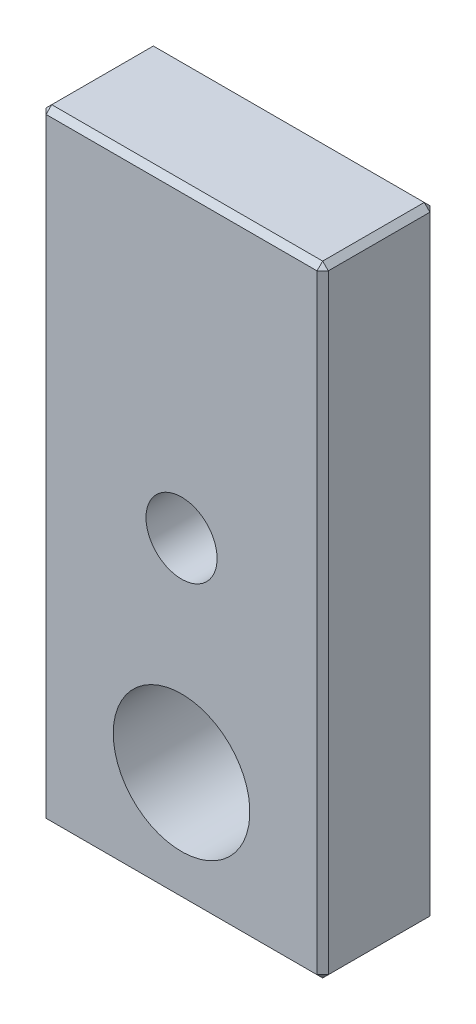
ISO-10303-21;
HEADER;
FILE_DESCRIPTION(('STEP AP214'),'2;1');
FILE_NAME('part.step','',(''),(''),'','','');
FILE_SCHEMA(('AUTOMOTIVE_DESIGN { 1 0 10303 214 1 1 1 1 }'));
ENDSEC;
DATA;
#1=APPLICATION_CONTEXT('core data for automotive mechanical design processes');
#2=APPLICATION_PROTOCOL_DEFINITION('international standard','automotive_design',2000,#1);
#3=PRODUCT_CONTEXT('',#1,'mechanical');
#4=PRODUCT('Part','Part','',(#3));
#5=PRODUCT_RELATED_PRODUCT_CATEGORY('part','',(#4));
#6=PRODUCT_DEFINITION_FORMATION('','',#4);
#7=PRODUCT_DEFINITION_CONTEXT('part definition',#1,'design');
#8=PRODUCT_DEFINITION('design','',#6,#7);
#9=PRODUCT_DEFINITION_SHAPE('','',#8);
#10=(LENGTH_UNIT() NAMED_UNIT(*) SI_UNIT(.MILLI.,.METRE.));
#11=(NAMED_UNIT(*) PLANE_ANGLE_UNIT() SI_UNIT($,.RADIAN.));
#12=(NAMED_UNIT(*) SI_UNIT($,.STERADIAN.) SOLID_ANGLE_UNIT());
#13=UNCERTAINTY_MEASURE_WITH_UNIT(LENGTH_MEASURE(1.E-05),#10,'distance_accuracy_value','');
#14=(GEOMETRIC_REPRESENTATION_CONTEXT(3) GLOBAL_UNCERTAINTY_ASSIGNED_CONTEXT((#13)) GLOBAL_UNIT_ASSIGNED_CONTEXT((#10,
#11,#12)) REPRESENTATION_CONTEXT('',''));
#15=CARTESIAN_POINT('',(0.,0.,0.));
#16=DIRECTION('',(0.,0.,1.));
#17=DIRECTION('',(1.,0.,0.));
#18=AXIS2_PLACEMENT_3D('',#15,#16,#17);
#19=CARTESIAN_POINT('',(-12.25,44.75,9.5));
#20=DIRECTION('',(-0.577350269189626,0.577350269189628,0.577350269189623));
#21=DIRECTION('',(-0.707106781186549,-0.707106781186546,0.));
#22=AXIS2_PLACEMENT_3D('',#19,#20,#21);
#23=PLANE('',#22);
#24=DIRECTION('',(0.,-0.707106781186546,0.707106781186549));
#25=VECTOR('',#24,1.);
#26=CARTESIAN_POINT('',(-12.,44.75,9.75));
#27=LINE('',#26,#25);
#28=CARTESIAN_POINT('',(-12.,45.,9.5));
#29=VERTEX_POINT('',#28);
#30=CARTESIAN_POINT('',(-12.,44.5,10.));
#31=VERTEX_POINT('',#30);
#32=EDGE_CURVE('E329',#29,#31,#27,.T.);
#33=ORIENTED_EDGE('',*,*,#32,.F.);
#34=DIRECTION('',(-0.707106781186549,-0.707106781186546,0.));
#35=VECTOR('',#34,1.);
#36=CARTESIAN_POINT('',(-12.25,44.75,9.5));
#37=LINE('',#36,#35);
#38=CARTESIAN_POINT('',(-12.5,44.5,9.5));
#39=VERTEX_POINT('',#38);
#40=EDGE_CURVE('E303',#39,#29,#37,.F.);
#41=ORIENTED_EDGE('',*,*,#40,.F.);
#42=DIRECTION('',(0.707106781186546,0.,0.707106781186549));
#43=VECTOR('',#42,1.);
#44=CARTESIAN_POINT('',(-12.25,44.5,9.75000000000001));
#45=LINE('',#44,#43);
#46=EDGE_CURVE('E313',#31,#39,#45,.F.);
#47=ORIENTED_EDGE('',*,*,#46,.F.);
#48=EDGE_LOOP('',(#33,#41,#47));
#49=FACE_BOUND('',#48,.T.);
#50=ADVANCED_FACE('F17',(#49),#23,.T.);
#51=CARTESIAN_POINT('',(-12.25,-9.75,9.5));
#52=DIRECTION('',(-0.577350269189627,-0.577350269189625,0.577350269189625));
#53=DIRECTION('',(0.707106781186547,0.,0.707106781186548));
#54=AXIS2_PLACEMENT_3D('',#51,#52,#53);
#55=PLANE('',#54);
#56=DIRECTION('',(0.,-0.707106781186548,-0.707106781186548));
#57=VECTOR('',#56,1.);
#58=CARTESIAN_POINT('',(-12.,-9.75,9.75));
#59=LINE('',#58,#57);
#60=CARTESIAN_POINT('',(-12.,-9.5,10.));
#61=VERTEX_POINT('',#60);
#62=CARTESIAN_POINT('',(-12.,-10.,9.5));
#63=VERTEX_POINT('',#62);
#64=EDGE_CURVE('E127',#61,#63,#59,.T.);
#65=ORIENTED_EDGE('',*,*,#64,.F.);
#66=DIRECTION('',(0.707106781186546,0.,0.707106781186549));
#67=VECTOR('',#66,1.);
#68=CARTESIAN_POINT('',(-12.25,-9.5,9.75));
#69=LINE('',#68,#67);
#70=CARTESIAN_POINT('',(-12.5,-9.5,9.5));
#71=VERTEX_POINT('',#70);
#72=EDGE_CURVE('E310',#71,#61,#69,.T.);
#73=ORIENTED_EDGE('',*,*,#72,.F.);
#74=DIRECTION('',(0.707106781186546,-0.707106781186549,0.));
#75=VECTOR('',#74,1.);
#76=CARTESIAN_POINT('',(-12.25,-9.75,9.5));
#77=LINE('',#76,#75);
#78=EDGE_CURVE('E126',#63,#71,#77,.F.);
#79=ORIENTED_EDGE('',*,*,#78,.F.);
#80=EDGE_LOOP('',(#65,#73,#79));
#81=FACE_BOUND('',#80,.T.);
#82=ADVANCED_FACE('F323',(#81),#55,.T.);
#83=CARTESIAN_POINT('',(12.,45.,9.5));
#84=DIRECTION('',(0.577350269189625,0.577350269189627,0.577350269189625));
#85=DIRECTION('',(0.,-0.707106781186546,0.707106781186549));
#86=AXIS2_PLACEMENT_3D('',#83,#84,#85);
#87=PLANE('',#86);
#88=DIRECTION('',(-0.707106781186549,0.707106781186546,0.));
#89=VECTOR('',#88,1.);
#90=CARTESIAN_POINT('',(12.25,44.75,9.5));
#91=LINE('',#90,#89);
#92=CARTESIAN_POINT('',(12.,45.,9.5));
#93=VERTEX_POINT('',#92);
#94=CARTESIAN_POINT('',(12.5,44.5,9.5));
#95=VERTEX_POINT('',#94);
#96=EDGE_CURVE('E149',#93,#95,#91,.F.);
#97=ORIENTED_EDGE('',*,*,#96,.F.);
#98=DIRECTION('',(0.,-0.707106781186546,0.707106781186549));
#99=VECTOR('',#98,1.);
#100=CARTESIAN_POINT('',(12.,44.75,9.75));
#101=LINE('',#100,#99);
#102=CARTESIAN_POINT('',(12.,44.5,10.));
#103=VERTEX_POINT('',#102);
#104=EDGE_CURVE('E330',#103,#93,#101,.F.);
#105=ORIENTED_EDGE('',*,*,#104,.F.);
#106=DIRECTION('',(0.707106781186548,0.,-0.707106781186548));
#107=VECTOR('',#106,1.);
#108=CARTESIAN_POINT('',(12.25,44.5,9.75));
#109=LINE('',#108,#107);
#110=EDGE_CURVE('E148',#95,#103,#109,.F.);
#111=ORIENTED_EDGE('',*,*,#110,.F.);
#112=EDGE_LOOP('',(#97,#105,#111));
#113=FACE_BOUND('',#112,.T.);
#114=ADVANCED_FACE('F338',(#113),#87,.T.);
#115=CARTESIAN_POINT('',(12.25,-9.75,9.5));
#116=DIRECTION('',(0.577350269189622,-0.577350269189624,0.577350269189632));
#117=DIRECTION('',(0.,-0.707106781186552,-0.707106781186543));
#118=AXIS2_PLACEMENT_3D('',#115,#116,#117);
#119=PLANE('',#118);
#120=DIRECTION('',(0.707106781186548,0.,-0.707106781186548));
#121=VECTOR('',#120,1.);
#122=CARTESIAN_POINT('',(12.25,-9.50000000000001,9.74999999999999));
#123=LINE('',#122,#121);
#124=CARTESIAN_POINT('',(12.,-9.5,10.));
#125=VERTEX_POINT('',#124);
#126=CARTESIAN_POINT('',(12.5,-9.50000000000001,9.5));
#127=VERTEX_POINT('',#126);
#128=EDGE_CURVE('E142',#125,#127,#123,.T.);
#129=ORIENTED_EDGE('',*,*,#128,.F.);
#130=DIRECTION('',(0.,-0.707106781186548,-0.707106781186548));
#131=VECTOR('',#130,1.);
#132=CARTESIAN_POINT('',(12.,-9.75,9.75));
#133=LINE('',#132,#131);
#134=CARTESIAN_POINT('',(12.,-10.,9.5));
#135=VERTEX_POINT('',#134);
#136=EDGE_CURVE('E117',#135,#125,#133,.F.);
#137=ORIENTED_EDGE('',*,*,#136,.F.);
#138=DIRECTION('',(0.707106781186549,0.707106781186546,0.));
#139=VECTOR('',#138,1.);
#140=CARTESIAN_POINT('',(12.25,-9.75,9.5));
#141=LINE('',#140,#139);
#142=EDGE_CURVE('E144',#127,#135,#141,.F.);
#143=ORIENTED_EDGE('',*,*,#142,.F.);
#144=EDGE_LOOP('',(#129,#137,#143));
#145=FACE_BOUND('',#144,.T.);
#146=ADVANCED_FACE('F143',(#145),#119,.T.);
#147=CARTESIAN_POINT('',(-6.25000000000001,44.75,9.75));
#148=DIRECTION('',(0.,0.707106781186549,0.707106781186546));
#149=DIRECTION('',(0.,-0.707106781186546,0.707106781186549));
#150=AXIS2_PLACEMENT_3D('',#147,#148,#149);
#151=PLANE('',#150);
#152=ORIENTED_EDGE('',*,*,#32,.T.);
#153=DIRECTION('',(1.,0.,0.));
#154=VECTOR('',#153,1.);
#155=CARTESIAN_POINT('',(0.,44.5,10.));
#156=LINE('',#155,#154);
#157=EDGE_CURVE('E162',#103,#31,#156,.F.);
#158=ORIENTED_EDGE('',*,*,#157,.F.);
#159=ORIENTED_EDGE('',*,*,#104,.T.);
#160=DIRECTION('',(1.,0.,0.));
#161=VECTOR('',#160,1.);
#162=CARTESIAN_POINT('',(-12.5,45.,9.5));
#163=LINE('',#162,#161);
#164=EDGE_CURVE('E164',#29,#93,#163,.T.);
#165=ORIENTED_EDGE('',*,*,#164,.F.);
#166=EDGE_LOOP('',(#152,#158,#159,#165));
#167=FACE_BOUND('',#166,.T.);
#168=ADVANCED_FACE('F336',(#167),#151,.T.);
#169=CARTESIAN_POINT('',(-12.25,3.75,9.75));
#170=DIRECTION('',(-0.707106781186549,0.,0.707106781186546));
#171=DIRECTION('',(0.707106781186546,0.,0.707106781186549));
#172=AXIS2_PLACEMENT_3D('',#169,#170,#171);
#173=PLANE('',#172);
#174=ORIENTED_EDGE('',*,*,#72,.T.);
#175=DIRECTION('',(0.,1.,0.));
#176=VECTOR('',#175,1.);
#177=CARTESIAN_POINT('',(-12.,17.5,10.));
#178=LINE('',#177,#176);
#179=EDGE_CURVE('E139',#31,#61,#178,.F.);
#180=ORIENTED_EDGE('',*,*,#179,.F.);
#181=ORIENTED_EDGE('',*,*,#46,.T.);
#182=DIRECTION('',(0.,-1.,0.));
#183=VECTOR('',#182,1.);
#184=CARTESIAN_POINT('',(-12.5,-10.,9.5));
#185=LINE('',#184,#183);
#186=EDGE_CURVE('E174',#71,#39,#185,.F.);
#187=ORIENTED_EDGE('',*,*,#186,.F.);
#188=EDGE_LOOP('',(#174,#180,#181,#187));
#189=FACE_BOUND('',#188,.T.);
#190=ADVANCED_FACE('F325',(#189),#173,.T.);
#191=CARTESIAN_POINT('',(-12.25,44.75,0.));
#192=DIRECTION('',(-0.707106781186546,0.707106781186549,0.));
#193=DIRECTION('',(-0.707106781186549,-0.707106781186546,0.));
#194=AXIS2_PLACEMENT_3D('',#191,#192,#193);
#195=PLANE('',#194);
#196=DIRECTION('',(-0.707106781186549,-0.707106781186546,0.));
#197=VECTOR('',#196,1.);
#198=CARTESIAN_POINT('',(-12.25,44.75,0.5));
#199=LINE('',#198,#197);
#200=CARTESIAN_POINT('',(-12.,45.,0.5));
#201=VERTEX_POINT('',#200);
#202=CARTESIAN_POINT('',(-12.5,44.5,0.499999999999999));
#203=VERTEX_POINT('',#202);
#204=EDGE_CURVE('E304',#201,#203,#199,.T.);
#205=ORIENTED_EDGE('',*,*,#204,.T.);
#206=DIRECTION('',(0.,0.,1.));
#207=VECTOR('',#206,1.);
#208=CARTESIAN_POINT('',(-12.5,44.5,0.));
#209=LINE('',#208,#207);
#210=EDGE_CURVE('E170',#39,#203,#209,.F.);
#211=ORIENTED_EDGE('',*,*,#210,.F.);
#212=ORIENTED_EDGE('',*,*,#40,.T.);
#213=DIRECTION('',(0.,0.,1.));
#214=VECTOR('',#213,1.);
#215=CARTESIAN_POINT('',(-12.,45.,0.));
#216=LINE('',#215,#214);
#217=EDGE_CURVE('E156',#201,#29,#216,.T.);
#218=ORIENTED_EDGE('',*,*,#217,.F.);
#219=EDGE_LOOP('',(#205,#211,#212,#218));
#220=FACE_BOUND('',#219,.T.);
#221=ADVANCED_FACE('F301',(#220),#195,.T.);
#222=CARTESIAN_POINT('',(6.25,-9.75,9.75));
#223=DIRECTION('',(0.,-0.707106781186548,0.707106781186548));
#224=DIRECTION('',(0.,-0.707106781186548,-0.707106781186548));
#225=AXIS2_PLACEMENT_3D('',#222,#223,#224);
#226=PLANE('',#225);
#227=ORIENTED_EDGE('',*,*,#136,.T.);
#228=DIRECTION('',(1.,0.,0.));
#229=VECTOR('',#228,1.);
#230=CARTESIAN_POINT('',(0.,-9.5,10.));
#231=LINE('',#230,#229);
#232=EDGE_CURVE('E120',#61,#125,#231,.T.);
#233=ORIENTED_EDGE('',*,*,#232,.F.);
#234=ORIENTED_EDGE('',*,*,#64,.T.);
#235=DIRECTION('',(1.,0.,0.));
#236=VECTOR('',#235,1.);
#237=CARTESIAN_POINT('',(12.5,-10.,9.5));
#238=LINE('',#237,#236);
#239=EDGE_CURVE('E122',#135,#63,#238,.F.);
#240=ORIENTED_EDGE('',*,*,#239,.F.);
#241=EDGE_LOOP('',(#227,#233,#234,#240));
#242=FACE_BOUND('',#241,.T.);
#243=ADVANCED_FACE('F119',(#242),#226,.T.);
#244=CARTESIAN_POINT('',(-12.25,-9.75,0.));
#245=DIRECTION('',(-0.707106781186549,-0.707106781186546,0.));
#246=DIRECTION('',(0.707106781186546,-0.707106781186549,0.));
#247=AXIS2_PLACEMENT_3D('',#244,#245,#246);
#248=PLANE('',#247);
#249=DIRECTION('',(0.707106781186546,-0.707106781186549,0.));
#250=VECTOR('',#249,1.);
#251=CARTESIAN_POINT('',(-12.25,-9.75,0.5));
#252=LINE('',#251,#250);
#253=CARTESIAN_POINT('',(-12.5,-9.5,0.5));
#254=VERTEX_POINT('',#253);
#255=CARTESIAN_POINT('',(-12.,-10.,0.5));
#256=VERTEX_POINT('',#255);
#257=EDGE_CURVE('E286',#254,#256,#252,.T.);
#258=ORIENTED_EDGE('',*,*,#257,.T.);
#259=DIRECTION('',(0.,0.,-1.));
#260=VECTOR('',#259,1.);
#261=CARTESIAN_POINT('',(-12.,-10.,0.));
#262=LINE('',#261,#260);
#263=EDGE_CURVE('E179',#63,#256,#262,.T.);
#264=ORIENTED_EDGE('',*,*,#263,.F.);
#265=ORIENTED_EDGE('',*,*,#78,.T.);
#266=DIRECTION('',(0.,0.,1.));
#267=VECTOR('',#266,1.);
#268=CARTESIAN_POINT('',(-12.5,-9.5,0.));
#269=LINE('',#268,#267);
#270=EDGE_CURVE('E167',#254,#71,#269,.T.);
#271=ORIENTED_EDGE('',*,*,#270,.F.);
#272=EDGE_LOOP('',(#258,#264,#265,#271));
#273=FACE_BOUND('',#272,.T.);
#274=ADVANCED_FACE('F291',(#273),#248,.T.);
#275=CARTESIAN_POINT('',(12.25,44.75,0.));
#276=DIRECTION('',(0.707106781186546,0.707106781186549,0.));
#277=DIRECTION('',(-0.707106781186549,0.707106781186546,0.));
#278=AXIS2_PLACEMENT_3D('',#275,#276,#277);
#279=PLANE('',#278);
#280=DIRECTION('',(0.707106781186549,-0.707106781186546,0.));
#281=VECTOR('',#280,1.);
#282=CARTESIAN_POINT('',(12.,45.,0.500000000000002));
#283=LINE('',#282,#281);
#284=CARTESIAN_POINT('',(12.,45.,0.5));
#285=VERTEX_POINT('',#284);
#286=CARTESIAN_POINT('',(12.5,44.5,0.5));
#287=VERTEX_POINT('',#286);
#288=EDGE_CURVE('E182',#285,#287,#283,.T.);
#289=ORIENTED_EDGE('',*,*,#288,.F.);
#290=DIRECTION('',(0.,0.,1.));
#291=VECTOR('',#290,1.);
#292=CARTESIAN_POINT('',(12.,45.,0.));
#293=LINE('',#292,#291);
#294=EDGE_CURVE('E154',#93,#285,#293,.F.);
#295=ORIENTED_EDGE('',*,*,#294,.F.);
#296=ORIENTED_EDGE('',*,*,#96,.T.);
#297=DIRECTION('',(0.,0.,1.));
#298=VECTOR('',#297,1.);
#299=CARTESIAN_POINT('',(12.5,44.5,0.));
#300=LINE('',#299,#298);
#301=EDGE_CURVE('E187',#287,#95,#300,.T.);
#302=ORIENTED_EDGE('',*,*,#301,.F.);
#303=EDGE_LOOP('',(#289,#295,#296,#302));
#304=FACE_BOUND('',#303,.T.);
#305=ADVANCED_FACE('F345',(#304),#279,.T.);
#306=CARTESIAN_POINT('',(12.25,31.25,9.75));
#307=DIRECTION('',(0.707106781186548,0.,0.707106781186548));
#308=DIRECTION('',(0.707106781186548,0.,-0.707106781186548));
#309=AXIS2_PLACEMENT_3D('',#306,#307,#308);
#310=PLANE('',#309);
#311=ORIENTED_EDGE('',*,*,#110,.T.);
#312=DIRECTION('',(0.,1.,0.));
#313=VECTOR('',#312,1.);
#314=CARTESIAN_POINT('',(12.,17.5,10.));
#315=LINE('',#314,#313);
#316=EDGE_CURVE('E136',#125,#103,#315,.T.);
#317=ORIENTED_EDGE('',*,*,#316,.F.);
#318=ORIENTED_EDGE('',*,*,#128,.T.);
#319=DIRECTION('',(0.,1.,0.));
#320=VECTOR('',#319,1.);
#321=CARTESIAN_POINT('',(12.5,45.,9.5));
#322=LINE('',#321,#320);
#323=EDGE_CURVE('E190',#95,#127,#322,.F.);
#324=ORIENTED_EDGE('',*,*,#323,.F.);
#325=EDGE_LOOP('',(#311,#317,#318,#324));
#326=FACE_BOUND('',#325,.T.);
#327=ADVANCED_FACE('F151',(#326),#310,.T.);
#328=CARTESIAN_POINT('',(12.25,-9.75,0.));
#329=DIRECTION('',(0.707106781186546,-0.707106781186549,0.));
#330=DIRECTION('',(0.707106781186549,0.707106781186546,0.));
#331=AXIS2_PLACEMENT_3D('',#328,#329,#330);
#332=PLANE('',#331);
#333=DIRECTION('',(0.707106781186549,0.707106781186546,0.));
#334=VECTOR('',#333,1.);
#335=CARTESIAN_POINT('',(12.25,-9.75,0.5));
#336=LINE('',#335,#334);
#337=CARTESIAN_POINT('',(12.,-10.,0.5));
#338=VERTEX_POINT('',#337);
#339=CARTESIAN_POINT('',(12.5,-9.50000000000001,0.500000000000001));
#340=VERTEX_POINT('',#339);
#341=EDGE_CURVE('E57',#338,#340,#336,.T.);
#342=ORIENTED_EDGE('',*,*,#341,.T.);
#343=DIRECTION('',(0.,0.,1.));
#344=VECTOR('',#343,1.);
#345=CARTESIAN_POINT('',(12.5,-9.50000000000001,0.));
#346=LINE('',#345,#344);
#347=EDGE_CURVE('E188',#127,#340,#346,.F.);
#348=ORIENTED_EDGE('',*,*,#347,.F.);
#349=ORIENTED_EDGE('',*,*,#142,.T.);
#350=DIRECTION('',(0.,0.,-1.));
#351=VECTOR('',#350,1.);
#352=CARTESIAN_POINT('',(12.,-10.,0.));
#353=LINE('',#352,#351);
#354=EDGE_CURVE('E173',#338,#135,#353,.F.);
#355=ORIENTED_EDGE('',*,*,#354,.F.);
#356=EDGE_LOOP('',(#342,#348,#349,#355));
#357=FACE_BOUND('',#356,.T.);
#358=ADVANCED_FACE('F319',(#357),#332,.T.);
#359=CARTESIAN_POINT('',(0.,17.5,10.));
#360=DIRECTION('',(0.,0.,1.));
#361=DIRECTION('',(1.,0.,0.));
#362=AXIS2_PLACEMENT_3D('',#359,#360,#361);
#363=PLANE('',#362);
#364=ORIENTED_EDGE('',*,*,#232,.T.);
#365=ORIENTED_EDGE('',*,*,#316,.T.);
#366=ORIENTED_EDGE('',*,*,#157,.T.);
#367=ORIENTED_EDGE('',*,*,#179,.T.);
#368=EDGE_LOOP('',(#364,#365,#366,#367));
#369=FACE_BOUND('',#368,.T.);
#370=CARTESIAN_POINT('',(0.,18.,10.));
#371=DIRECTION('',(0.,0.,-1.));
#372=DIRECTION('',(-1.,0.,0.));
#373=AXIS2_PLACEMENT_3D('',#370,#371,#372);
#374=CIRCLE('',#373,3.15);
#375=CARTESIAN_POINT('',(-3.15,18.,10.));
#376=VERTEX_POINT('',#375);
#377=EDGE_CURVE('E201',#376,#376,#374,.T.);
#378=ORIENTED_EDGE('',*,*,#377,.T.);
#379=EDGE_LOOP('',(#378));
#380=FACE_BOUND('',#379,.T.);
#381=CARTESIAN_POINT('',(0.,0.,10.));
#382=DIRECTION('',(0.,0.,-1.));
#383=DIRECTION('',(-1.,0.,0.));
#384=AXIS2_PLACEMENT_3D('',#381,#382,#383);
#385=CIRCLE('',#384,6.05);
#386=CARTESIAN_POINT('',(-6.05,0.,10.));
#387=VERTEX_POINT('',#386);
#388=EDGE_CURVE('E21',#387,#387,#385,.T.);
#389=ORIENTED_EDGE('',*,*,#388,.T.);
#390=EDGE_LOOP('',(#389));
#391=FACE_BOUND('',#390,.T.);
#392=ADVANCED_FACE('F132',(#369,#380,#391),#363,.T.);
#393=CARTESIAN_POINT('',(-12.5,45.,0.));
#394=DIRECTION('',(0.,1.,0.));
#395=DIRECTION('',(0.,0.,1.));
#396=AXIS2_PLACEMENT_3D('',#393,#394,#395);
#397=PLANE('',#396);
#398=ORIENTED_EDGE('',*,*,#217,.T.);
#399=ORIENTED_EDGE('',*,*,#164,.T.);
#400=ORIENTED_EDGE('',*,*,#294,.T.);
#401=DIRECTION('',(1.,0.,0.));
#402=VECTOR('',#401,1.);
#403=CARTESIAN_POINT('',(-6.25000000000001,45.,0.500000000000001));
#404=LINE('',#403,#402);
#405=EDGE_CURVE('E196',#201,#285,#404,.T.);
#406=ORIENTED_EDGE('',*,*,#405,.F.);
#407=EDGE_LOOP('',(#398,#399,#400,#406));
#408=FACE_BOUND('',#407,.T.);
#409=ADVANCED_FACE('F343',(#408),#397,.T.);
#410=CARTESIAN_POINT('',(-12.5,-10.,0.));
#411=DIRECTION('',(-1.,0.,0.));
#412=DIRECTION('',(0.,-1.,0.));
#413=AXIS2_PLACEMENT_3D('',#410,#411,#412);
#414=PLANE('',#413);
#415=ORIENTED_EDGE('',*,*,#186,.T.);
#416=ORIENTED_EDGE('',*,*,#210,.T.);
#417=DIRECTION('',(0.,1.,0.));
#418=VECTOR('',#417,1.);
#419=CARTESIAN_POINT('',(-12.5,3.75,0.499999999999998));
#420=LINE('',#419,#418);
#421=EDGE_CURVE('E205',#254,#203,#420,.T.);
#422=ORIENTED_EDGE('',*,*,#421,.F.);
#423=ORIENTED_EDGE('',*,*,#270,.T.);
#424=EDGE_LOOP('',(#415,#416,#422,#423));
#425=FACE_BOUND('',#424,.T.);
#426=ADVANCED_FACE('F296',(#425),#414,.T.);
#427=CARTESIAN_POINT('',(-12.,44.5,0.));
#428=DIRECTION('',(-0.577350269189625,0.577350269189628,-0.577350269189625));
#429=DIRECTION('',(0.,0.707106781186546,0.707106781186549));
#430=AXIS2_PLACEMENT_3D('',#427,#428,#429);
#431=PLANE('',#430);
#432=DIRECTION('',(0.,0.707106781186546,0.707106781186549));
#433=VECTOR('',#432,1.);
#434=CARTESIAN_POINT('',(-12.,44.75,0.25));
#435=LINE('',#434,#433);
#436=CARTESIAN_POINT('',(-12.,44.5,0.));
#437=VERTEX_POINT('',#436);
#438=EDGE_CURVE('E198',#437,#201,#435,.T.);
#439=ORIENTED_EDGE('',*,*,#438,.F.);
#440=DIRECTION('',(-0.707106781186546,0.,0.707106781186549));
#441=VECTOR('',#440,1.);
#442=CARTESIAN_POINT('',(-12.25,44.5,0.249999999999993));
#443=LINE('',#442,#441);
#444=EDGE_CURVE('E202',#203,#437,#443,.F.);
#445=ORIENTED_EDGE('',*,*,#444,.F.);
#446=ORIENTED_EDGE('',*,*,#204,.F.);
#447=EDGE_LOOP('',(#439,#445,#446));
#448=FACE_BOUND('',#447,.T.);
#449=ADVANCED_FACE('F350',(#448),#431,.T.);
#450=CARTESIAN_POINT('',(12.5,-10.,0.));
#451=DIRECTION('',(0.,-1.,0.));
#452=DIRECTION('',(0.,0.,-1.));
#453=AXIS2_PLACEMENT_3D('',#450,#451,#452);
#454=PLANE('',#453);
#455=ORIENTED_EDGE('',*,*,#239,.T.);
#456=ORIENTED_EDGE('',*,*,#263,.T.);
#457=DIRECTION('',(1.,0.,0.));
#458=VECTOR('',#457,1.);
#459=CARTESIAN_POINT('',(6.25,-10.,0.5));
#460=LINE('',#459,#458);
#461=EDGE_CURVE('E213',#338,#256,#460,.F.);
#462=ORIENTED_EDGE('',*,*,#461,.F.);
#463=ORIENTED_EDGE('',*,*,#354,.T.);
#464=EDGE_LOOP('',(#455,#456,#462,#463));
#465=FACE_BOUND('',#464,.T.);
#466=ADVANCED_FACE('F321',(#465),#454,.T.);
#467=CARTESIAN_POINT('',(-12.,-10.,0.5));
#468=DIRECTION('',(-0.577350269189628,-0.577350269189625,-0.577350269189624));
#469=DIRECTION('',(0.707106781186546,-0.707106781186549,0.));
#470=AXIS2_PLACEMENT_3D('',#467,#468,#469);
#471=PLANE('',#470);
#472=DIRECTION('',(0.,0.707106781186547,-0.707106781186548));
#473=VECTOR('',#472,1.);
#474=CARTESIAN_POINT('',(-12.,-9.75,0.25));
#475=LINE('',#474,#473);
#476=CARTESIAN_POINT('',(-12.,-9.5,0.));
#477=VERTEX_POINT('',#476);
#478=EDGE_CURVE('E210',#256,#477,#475,.T.);
#479=ORIENTED_EDGE('',*,*,#478,.F.);
#480=ORIENTED_EDGE('',*,*,#257,.F.);
#481=DIRECTION('',(-0.707106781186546,0.,0.707106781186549));
#482=VECTOR('',#481,1.);
#483=CARTESIAN_POINT('',(-12.25,-9.5,0.250000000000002));
#484=LINE('',#483,#482);
#485=EDGE_CURVE('E195',#477,#254,#484,.T.);
#486=ORIENTED_EDGE('',*,*,#485,.F.);
#487=EDGE_LOOP('',(#479,#480,#486));
#488=FACE_BOUND('',#487,.T.);
#489=ADVANCED_FACE('F285',(#488),#471,.T.);
#490=CARTESIAN_POINT('',(12.25,44.5,0.25));
#491=DIRECTION('',(0.577350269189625,0.577350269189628,-0.577350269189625));
#492=DIRECTION('',(0.,0.707106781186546,0.707106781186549));
#493=AXIS2_PLACEMENT_3D('',#490,#491,#492);
#494=PLANE('',#493);
#495=ORIENTED_EDGE('',*,*,#288,.T.);
#496=DIRECTION('',(-0.707106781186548,0.,-0.707106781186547));
#497=VECTOR('',#496,1.);
#498=CARTESIAN_POINT('',(12.25,44.5,0.249999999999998));
#499=LINE('',#498,#497);
#500=CARTESIAN_POINT('',(12.,44.5,0.));
#501=VERTEX_POINT('',#500);
#502=EDGE_CURVE('E212',#501,#287,#499,.F.);
#503=ORIENTED_EDGE('',*,*,#502,.F.);
#504=DIRECTION('',(0.,0.707106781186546,0.707106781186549));
#505=VECTOR('',#504,1.);
#506=CARTESIAN_POINT('',(12.,44.75,0.25));
#507=LINE('',#506,#505);
#508=EDGE_CURVE('E49',#285,#501,#507,.F.);
#509=ORIENTED_EDGE('',*,*,#508,.F.);
#510=EDGE_LOOP('',(#495,#503,#509));
#511=FACE_BOUND('',#510,.T.);
#512=ADVANCED_FACE('F349',(#511),#494,.T.);
#513=CARTESIAN_POINT('',(12.5,45.,0.));
#514=DIRECTION('',(1.,0.,0.));
#515=DIRECTION('',(0.,1.,0.));
#516=AXIS2_PLACEMENT_3D('',#513,#514,#515);
#517=PLANE('',#516);
#518=ORIENTED_EDGE('',*,*,#347,.T.);
#519=DIRECTION('',(0.,1.,0.));
#520=VECTOR('',#519,1.);
#521=CARTESIAN_POINT('',(12.5,31.25,0.500000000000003));
#522=LINE('',#521,#520);
#523=EDGE_CURVE('E220',#287,#340,#522,.F.);
#524=ORIENTED_EDGE('',*,*,#523,.F.);
#525=ORIENTED_EDGE('',*,*,#301,.T.);
#526=ORIENTED_EDGE('',*,*,#323,.T.);
#527=EDGE_LOOP('',(#518,#524,#525,#526));
#528=FACE_BOUND('',#527,.T.);
#529=ADVANCED_FACE('F365',(#528),#517,.T.);
#530=CARTESIAN_POINT('',(12.,-9.75,0.25));
#531=DIRECTION('',(0.577350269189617,-0.577350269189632,-0.577350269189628));
#532=DIRECTION('',(0.,0.707106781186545,-0.70710678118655));
#533=AXIS2_PLACEMENT_3D('',#530,#531,#532);
#534=PLANE('',#533);
#535=DIRECTION('',(-0.707106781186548,0.,-0.707106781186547));
#536=VECTOR('',#535,1.);
#537=CARTESIAN_POINT('',(12.25,-9.50000000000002,0.250000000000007));
#538=LINE('',#537,#536);
#539=CARTESIAN_POINT('',(12.,-9.5,0.));
#540=VERTEX_POINT('',#539);
#541=EDGE_CURVE('E35',#340,#540,#538,.T.);
#542=ORIENTED_EDGE('',*,*,#541,.F.);
#543=ORIENTED_EDGE('',*,*,#341,.F.);
#544=DIRECTION('',(0.,0.707106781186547,-0.707106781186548));
#545=VECTOR('',#544,1.);
#546=CARTESIAN_POINT('',(12.,-9.75,0.25));
#547=LINE('',#546,#545);
#548=EDGE_CURVE('E204',#540,#338,#547,.F.);
#549=ORIENTED_EDGE('',*,*,#548,.F.);
#550=EDGE_LOOP('',(#542,#543,#549));
#551=FACE_BOUND('',#550,.T.);
#552=ADVANCED_FACE('F245',(#551),#534,.T.);
#553=CARTESIAN_POINT('',(0.,0.,61.2372435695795));
#554=DIRECTION('',(0.,0.,-1.));
#555=DIRECTION('',(-1.,0.,0.));
#556=AXIS2_PLACEMENT_3D('',#553,#554,#555);
#557=CYLINDRICAL_SURFACE('',#556,6.05);
#558=ORIENTED_EDGE('',*,*,#388,.F.);
#559=EDGE_LOOP('',(#558));
#560=FACE_BOUND('',#559,.T.);
#561=CARTESIAN_POINT('',(0.,0.,0.));
#562=DIRECTION('',(0.,0.,-1.));
#563=DIRECTION('',(-1.,0.,0.));
#564=AXIS2_PLACEMENT_3D('',#561,#562,#563);
#565=CIRCLE('',#564,6.05);
#566=CARTESIAN_POINT('',(-6.05,0.,0.));
#567=VERTEX_POINT('',#566);
#568=EDGE_CURVE('E219',#567,#567,#565,.T.);
#569=ORIENTED_EDGE('',*,*,#568,.T.);
#570=EDGE_LOOP('',(#569));
#571=FACE_BOUND('',#570,.T.);
#572=ADVANCED_FACE('F241',(#560,#571),#557,.F.);
#573=CARTESIAN_POINT('',(0.,18.,61.2372435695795));
#574=DIRECTION('',(0.,0.,-1.));
#575=DIRECTION('',(-1.,0.,0.));
#576=AXIS2_PLACEMENT_3D('',#573,#574,#575);
#577=CYLINDRICAL_SURFACE('',#576,3.15);
#578=ORIENTED_EDGE('',*,*,#377,.F.);
#579=EDGE_LOOP('',(#578));
#580=FACE_BOUND('',#579,.T.);
#581=CARTESIAN_POINT('',(0.,18.,0.));
#582=DIRECTION('',(0.,0.,-1.));
#583=DIRECTION('',(-1.,0.,0.));
#584=AXIS2_PLACEMENT_3D('',#581,#582,#583);
#585=CIRCLE('',#584,3.15);
#586=CARTESIAN_POINT('',(-3.15,18.,0.));
#587=VERTEX_POINT('',#586);
#588=EDGE_CURVE('E231',#587,#587,#585,.T.);
#589=ORIENTED_EDGE('',*,*,#588,.T.);
#590=EDGE_LOOP('',(#589));
#591=FACE_BOUND('',#590,.T.);
#592=ADVANCED_FACE('F244',(#580,#591),#577,.F.);
#593=CARTESIAN_POINT('',(-6.25000000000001,44.75,0.25));
#594=DIRECTION('',(0.,0.707106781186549,-0.707106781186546));
#595=DIRECTION('',(0.,0.707106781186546,0.707106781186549));
#596=AXIS2_PLACEMENT_3D('',#593,#594,#595);
#597=PLANE('',#596);
#598=ORIENTED_EDGE('',*,*,#508,.T.);
#599=DIRECTION('',(1.,0.,0.));
#600=VECTOR('',#599,1.);
#601=CARTESIAN_POINT('',(0.,44.5,0.));
#602=LINE('',#601,#600);
#603=EDGE_CURVE('E229',#501,#437,#602,.F.);
#604=ORIENTED_EDGE('',*,*,#603,.T.);
#605=ORIENTED_EDGE('',*,*,#438,.T.);
#606=ORIENTED_EDGE('',*,*,#405,.T.);
#607=EDGE_LOOP('',(#598,#604,#605,#606));
#608=FACE_BOUND('',#607,.T.);
#609=ADVANCED_FACE('F264',(#608),#597,.T.);
#610=CARTESIAN_POINT('',(-12.25,3.75,0.25));
#611=DIRECTION('',(-0.707106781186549,0.,-0.707106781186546));
#612=DIRECTION('',(-0.707106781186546,0.,0.707106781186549));
#613=AXIS2_PLACEMENT_3D('',#610,#611,#612);
#614=PLANE('',#613);
#615=ORIENTED_EDGE('',*,*,#444,.T.);
#616=DIRECTION('',(0.,1.,0.));
#617=VECTOR('',#616,1.);
#618=CARTESIAN_POINT('',(-12.,17.5,0.));
#619=LINE('',#618,#617);
#620=EDGE_CURVE('E226',#437,#477,#619,.F.);
#621=ORIENTED_EDGE('',*,*,#620,.T.);
#622=ORIENTED_EDGE('',*,*,#485,.T.);
#623=ORIENTED_EDGE('',*,*,#421,.T.);
#624=EDGE_LOOP('',(#615,#621,#622,#623));
#625=FACE_BOUND('',#624,.T.);
#626=ADVANCED_FACE('F270',(#625),#614,.T.);
#627=CARTESIAN_POINT('',(6.25,-9.75,0.25));
#628=DIRECTION('',(0.,-0.707106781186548,-0.707106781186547));
#629=DIRECTION('',(0.,0.707106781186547,-0.707106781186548));
#630=AXIS2_PLACEMENT_3D('',#627,#628,#629);
#631=PLANE('',#630);
#632=ORIENTED_EDGE('',*,*,#478,.T.);
#633=DIRECTION('',(1.,0.,0.));
#634=VECTOR('',#633,1.);
#635=CARTESIAN_POINT('',(0.,-9.5,0.));
#636=LINE('',#635,#634);
#637=EDGE_CURVE('E27',#477,#540,#636,.T.);
#638=ORIENTED_EDGE('',*,*,#637,.T.);
#639=ORIENTED_EDGE('',*,*,#548,.T.);
#640=ORIENTED_EDGE('',*,*,#461,.T.);
#641=EDGE_LOOP('',(#632,#638,#639,#640));
#642=FACE_BOUND('',#641,.T.);
#643=ADVANCED_FACE('F256',(#642),#631,.T.);
#644=CARTESIAN_POINT('',(12.25,31.25,0.25));
#645=DIRECTION('',(0.707106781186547,0.,-0.707106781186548));
#646=DIRECTION('',(-0.707106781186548,0.,-0.707106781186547));
#647=AXIS2_PLACEMENT_3D('',#644,#645,#646);
#648=PLANE('',#647);
#649=ORIENTED_EDGE('',*,*,#541,.T.);
#650=DIRECTION('',(0.,1.,0.));
#651=VECTOR('',#650,1.);
#652=CARTESIAN_POINT('',(12.,17.5,0.));
#653=LINE('',#652,#651);
#654=EDGE_CURVE('E11',#540,#501,#653,.T.);
#655=ORIENTED_EDGE('',*,*,#654,.T.);
#656=ORIENTED_EDGE('',*,*,#502,.T.);
#657=ORIENTED_EDGE('',*,*,#523,.T.);
#658=EDGE_LOOP('',(#649,#655,#656,#657));
#659=FACE_BOUND('',#658,.T.);
#660=ADVANCED_FACE('F250',(#659),#648,.T.);
#661=CARTESIAN_POINT('',(0.,17.5,0.));
#662=DIRECTION('',(0.,0.,1.));
#663=DIRECTION('',(1.,0.,0.));
#664=AXIS2_PLACEMENT_3D('',#661,#662,#663);
#665=PLANE('',#664);
#666=ORIENTED_EDGE('',*,*,#637,.F.);
#667=ORIENTED_EDGE('',*,*,#620,.F.);
#668=ORIENTED_EDGE('',*,*,#603,.F.);
#669=ORIENTED_EDGE('',*,*,#654,.F.);
#670=EDGE_LOOP('',(#666,#667,#668,#669));
#671=FACE_BOUND('',#670,.T.);
#672=ORIENTED_EDGE('',*,*,#588,.F.);
#673=EDGE_LOOP('',(#672));
#674=FACE_BOUND('',#673,.T.);
#675=ORIENTED_EDGE('',*,*,#568,.F.);
#676=EDGE_LOOP('',(#675));
#677=FACE_BOUND('',#676,.T.);
#678=ADVANCED_FACE('F19',(#671,#674,#677),#665,.F.);
#679=CLOSED_SHELL('',(#50,#82,#114,#146,#168,#190,#221,#243,#274,#305,#327,#358,#392,#409,#426,
#449,#466,#489,#512,#529,#552,#572,#592,#609,#626,#643,#660,#678));
#680=MANIFOLD_SOLID_BREP('B1',#679);
#681=ADVANCED_BREP_SHAPE_REPRESENTATION('',(#18,#680),#14);
#682=SHAPE_DEFINITION_REPRESENTATION(#9,#681);
ENDSEC;
END-ISO-10303-21;
